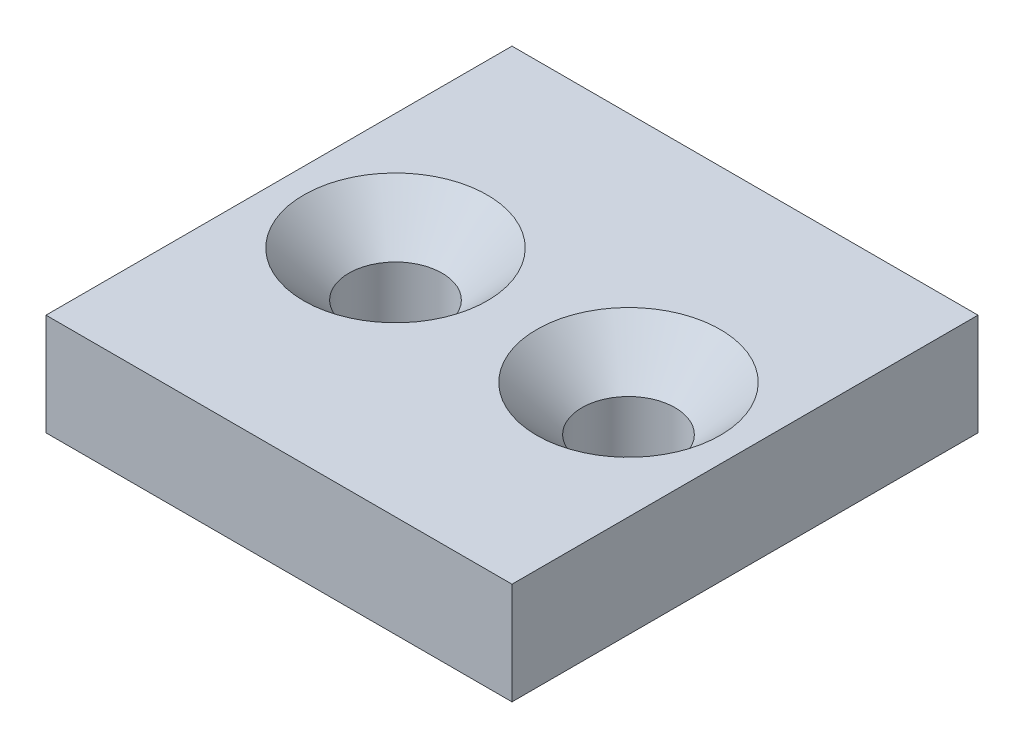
from build123d import *

# Parameters (mm, degrees)
SKETCH1_W                                       = 32
SKETCH1_H                                       = 32
BOSS_EXTRUDE1_DEPTH                             = 7
CSK_FOR_M6_FLAT_HEAD_MACHINE_SCREW1_D           = 6.4
CSK_FOR_M6_FLAT_HEAD_MACHINE_SCREW1_CSINK_D     = 12.6
CSK_FOR_M6_FLAT_HEAD_MACHINE_SCREW1_CSINK_ANGLE = 90


with BuildPart() as part:
    # Sketch1 → Boss-Extrude1 (new body)
    with BuildSketch(Plane(origin=(0, 0, 0), x_dir=(1, 0, 0), z_dir=(0, 1, 0))):
        Rectangle(SKETCH1_W, SKETCH1_H)
    extrude(amount=BOSS_EXTRUDE1_DEPTH)

    # CSK for M6 Flat Head Machine Screw1 (through all)
    with Locations(Plane(origin=(0, 7, 0), x_dir=(-1, 0, 0), z_dir=(0, 1, 0))):
        with Locations((8, 0), (-8, 0)):
            CounterSinkHole(CSK_FOR_M6_FLAT_HEAD_MACHINE_SCREW1_D / 2, CSK_FOR_M6_FLAT_HEAD_MACHINE_SCREW1_CSINK_D / 2, counter_sink_angle=CSK_FOR_M6_FLAT_HEAD_MACHINE_SCREW1_CSINK_ANGLE)


solid = part.part
